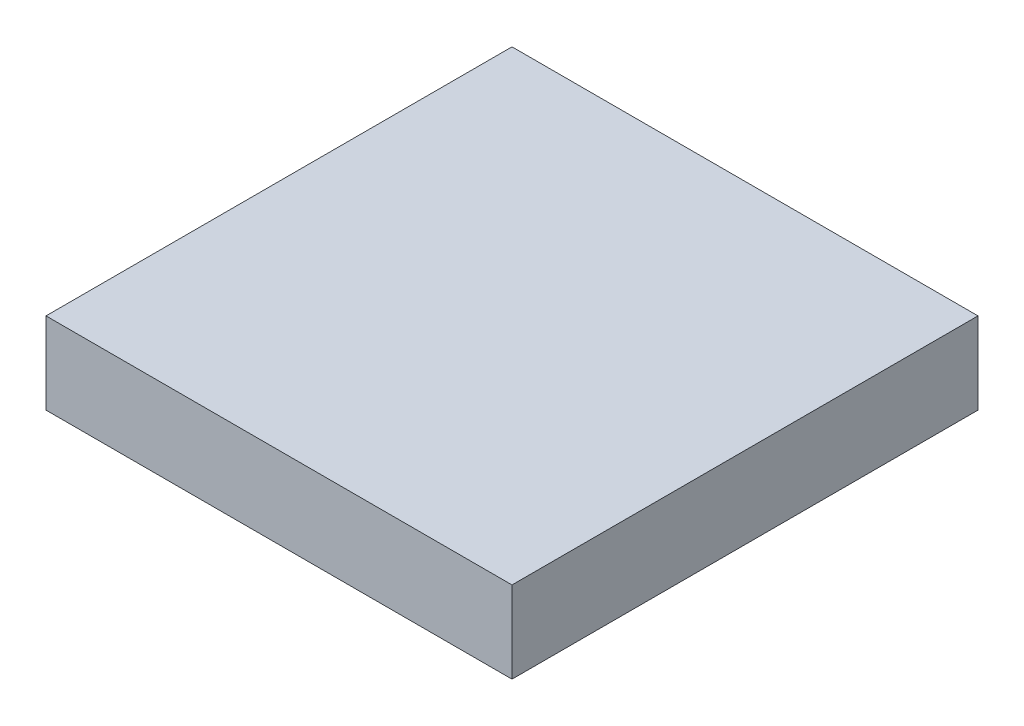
from build123d import *

# Parameters (mm, degrees)
SKETCH3_W           = 290
SKETCH3_H           = 290
BOSS_EXTRUDE1_DEPTH = 50.8


with BuildPart() as part:
    # Sketch3 → Boss-Extrude1 (new body)
    with BuildSketch(Plane(origin=(0, 0, 0), x_dir=(-1, 0, 0), z_dir=(0, 1, 0))):
        Rectangle(SKETCH3_W, SKETCH3_H)
    extrude(amount=BOSS_EXTRUDE1_DEPTH)


solid = part.part
